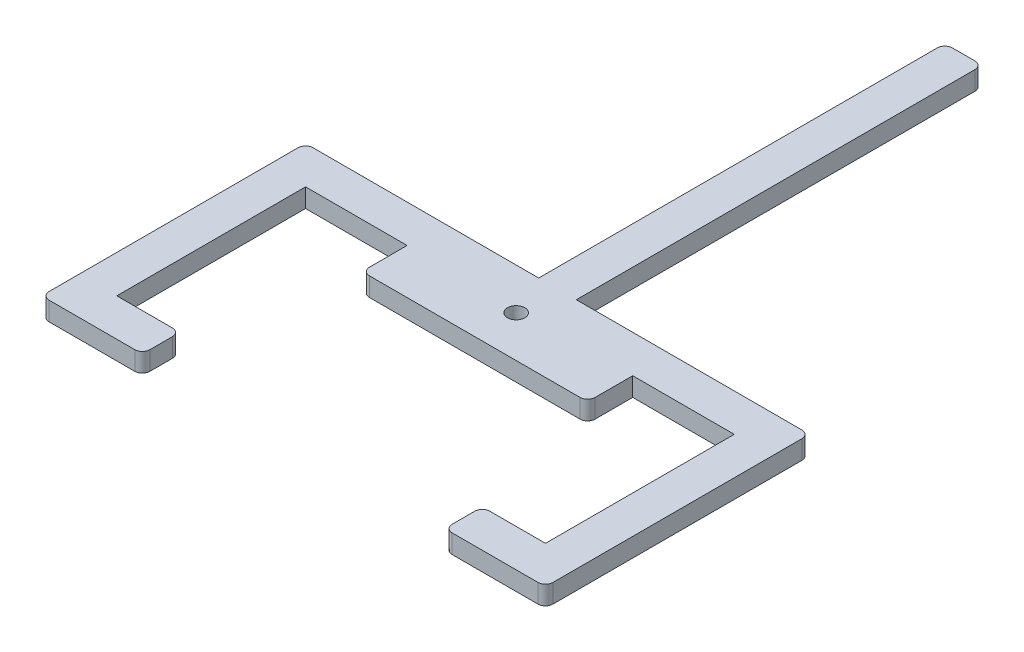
ISO-10303-21;
HEADER;
FILE_DESCRIPTION(('STEP AP214'),'2;1');
FILE_NAME('part.step','',(''),(''),'','','');
FILE_SCHEMA(('AUTOMOTIVE_DESIGN { 1 0 10303 214 1 1 1 1 }'));
ENDSEC;
DATA;
#1=APPLICATION_CONTEXT('core data for automotive mechanical design processes');
#2=APPLICATION_PROTOCOL_DEFINITION('international standard','automotive_design',2000,#1);
#3=PRODUCT_CONTEXT('',#1,'mechanical');
#4=PRODUCT('Part','Part','',(#3));
#5=PRODUCT_RELATED_PRODUCT_CATEGORY('part','',(#4));
#6=PRODUCT_DEFINITION_FORMATION('','',#4);
#7=PRODUCT_DEFINITION_CONTEXT('part definition',#1,'design');
#8=PRODUCT_DEFINITION('design','',#6,#7);
#9=PRODUCT_DEFINITION_SHAPE('','',#8);
#10=(LENGTH_UNIT() NAMED_UNIT(*) SI_UNIT(.MILLI.,.METRE.));
#11=(NAMED_UNIT(*) PLANE_ANGLE_UNIT() SI_UNIT($,.RADIAN.));
#12=(NAMED_UNIT(*) SI_UNIT($,.STERADIAN.) SOLID_ANGLE_UNIT());
#13=UNCERTAINTY_MEASURE_WITH_UNIT(LENGTH_MEASURE(1.E-05),#10,'distance_accuracy_value','');
#14=(GEOMETRIC_REPRESENTATION_CONTEXT(3) GLOBAL_UNCERTAINTY_ASSIGNED_CONTEXT((#13)) GLOBAL_UNIT_ASSIGNED_CONTEXT((#10,
#11,#12)) REPRESENTATION_CONTEXT('',''));
#15=CARTESIAN_POINT('',(0.,0.,0.));
#16=DIRECTION('',(0.,0.,1.));
#17=DIRECTION('',(1.,0.,0.));
#18=AXIS2_PLACEMENT_3D('',#15,#16,#17);
#19=CARTESIAN_POINT('',(39.37,3.175,74.93));
#20=DIRECTION('',(0.,0.,-1.));
#21=DIRECTION('',(-1.,0.,0.));
#22=AXIS2_PLACEMENT_3D('',#19,#20,#21);
#23=PLANE('',#22);
#24=DIRECTION('',(0.,-1.,0.));
#25=VECTOR('',#24,1.);
#26=CARTESIAN_POINT('',(22.225,3.175,74.93));
#27=LINE('',#26,#25);
#28=CARTESIAN_POINT('',(22.225,3.175,74.93));
#29=VERTEX_POINT('',#28);
#30=CARTESIAN_POINT('',(22.225,0.,74.93));
#31=VERTEX_POINT('',#30);
#32=EDGE_CURVE('E250',#29,#31,#27,.T.);
#33=ORIENTED_EDGE('',*,*,#32,.T.);
#34=DIRECTION('',(1.,0.,0.));
#35=VECTOR('',#34,1.);
#36=CARTESIAN_POINT('',(39.37,0.,74.93));
#37=LINE('',#36,#35);
#38=CARTESIAN_POINT('',(39.37,0.,74.93));
#39=VERTEX_POINT('',#38);
#40=EDGE_CURVE('E254',#31,#39,#37,.T.);
#41=ORIENTED_EDGE('',*,*,#40,.T.);
#42=DIRECTION('',(0.,-1.,0.));
#43=VECTOR('',#42,1.);
#44=CARTESIAN_POINT('',(39.37,3.175,74.93));
#45=LINE('',#44,#43);
#46=CARTESIAN_POINT('',(39.37,3.175,74.93));
#47=VERTEX_POINT('',#46);
#48=EDGE_CURVE('E387',#47,#39,#45,.T.);
#49=ORIENTED_EDGE('',*,*,#48,.F.);
#50=DIRECTION('',(1.,0.,0.));
#51=VECTOR('',#50,1.);
#52=CARTESIAN_POINT('',(39.37,3.175,74.93));
#53=LINE('',#52,#51);
#54=EDGE_CURVE('E268',#29,#47,#53,.T.);
#55=ORIENTED_EDGE('',*,*,#54,.F.);
#56=EDGE_LOOP('',(#33,#41,#49,#55));
#57=FACE_BOUND('',#56,.T.);
#58=ADVANCED_FACE('F33',(#57),#23,.F.);
#59=CARTESIAN_POINT('',(0.,3.175,74.93));
#60=DIRECTION('',(0.,0.,-1.));
#61=DIRECTION('',(-1.,0.,0.));
#62=AXIS2_PLACEMENT_3D('',#59,#60,#61);
#63=PLANE('',#62);
#64=DIRECTION('',(0.,-1.,0.));
#65=VECTOR('',#64,1.);
#66=CARTESIAN_POINT('',(-15.875,3.175,74.93));
#67=LINE('',#66,#65);
#68=CARTESIAN_POINT('',(-15.875,3.175,74.93));
#69=VERTEX_POINT('',#68);
#70=CARTESIAN_POINT('',(-15.875,0.,74.93));
#71=VERTEX_POINT('',#70);
#72=EDGE_CURVE('E269',#69,#71,#67,.T.);
#73=ORIENTED_EDGE('',*,*,#72,.F.);
#74=DIRECTION('',(1.,0.,0.));
#75=VECTOR('',#74,1.);
#76=CARTESIAN_POINT('',(0.,3.175,74.93));
#77=LINE('',#76,#75);
#78=CARTESIAN_POINT('',(-33.02,3.175,74.93));
#79=VERTEX_POINT('',#78);
#80=EDGE_CURVE('E333',#79,#69,#77,.T.);
#81=ORIENTED_EDGE('',*,*,#80,.F.);
#82=DIRECTION('',(0.,-1.,0.));
#83=VECTOR('',#82,1.);
#84=CARTESIAN_POINT('',(-33.02,3.175,74.93));
#85=LINE('',#84,#83);
#86=CARTESIAN_POINT('',(-33.02,0.,74.93));
#87=VERTEX_POINT('',#86);
#88=EDGE_CURVE('E389',#79,#87,#85,.T.);
#89=ORIENTED_EDGE('',*,*,#88,.T.);
#90=DIRECTION('',(1.,0.,0.));
#91=VECTOR('',#90,1.);
#92=CARTESIAN_POINT('',(0.,0.,74.93));
#93=LINE('',#92,#91);
#94=EDGE_CURVE('E369',#87,#71,#93,.T.);
#95=ORIENTED_EDGE('',*,*,#94,.T.);
#96=EDGE_LOOP('',(#73,#81,#89,#95));
#97=FACE_BOUND('',#96,.T.);
#98=ADVANCED_FACE('F563',(#97),#63,.F.);
#99=CARTESIAN_POINT('',(39.37,3.175,74.93));
#100=DIRECTION('',(1.,0.,0.));
#101=DIRECTION('',(0.,0.,-1.));
#102=AXIS2_PLACEMENT_3D('',#99,#100,#101);
#103=PLANE('',#102);
#104=DIRECTION('',(0.,-1.,0.));
#105=VECTOR('',#104,1.);
#106=CARTESIAN_POINT('',(39.37,3.175,106.807));
#107=LINE('',#106,#105);
#108=CARTESIAN_POINT('',(39.37,3.175,106.807));
#109=VERTEX_POINT('',#108);
#110=CARTESIAN_POINT('',(39.37,0.,106.807));
#111=VERTEX_POINT('',#110);
#112=EDGE_CURVE('E291',#109,#111,#107,.T.);
#113=ORIENTED_EDGE('',*,*,#112,.F.);
#114=DIRECTION('',(0.,0.,1.));
#115=VECTOR('',#114,1.);
#116=CARTESIAN_POINT('',(39.37,3.175,74.93));
#117=LINE('',#116,#115);
#118=EDGE_CURVE('E345',#47,#109,#117,.T.);
#119=ORIENTED_EDGE('',*,*,#118,.F.);
#120=ORIENTED_EDGE('',*,*,#48,.T.);
#121=DIRECTION('',(0.,0.,1.));
#122=VECTOR('',#121,1.);
#123=CARTESIAN_POINT('',(39.37,0.,74.93));
#124=LINE('',#123,#122);
#125=EDGE_CURVE('E262',#39,#111,#124,.T.);
#126=ORIENTED_EDGE('',*,*,#125,.T.);
#127=EDGE_LOOP('',(#113,#119,#120,#126));
#128=FACE_BOUND('',#127,.T.);
#129=ADVANCED_FACE('F580',(#128),#103,.F.);
#130=CARTESIAN_POINT('',(-33.02,3.175,74.93));
#131=DIRECTION('',(-1.,0.,0.));
#132=DIRECTION('',(0.,0.,1.));
#133=AXIS2_PLACEMENT_3D('',#130,#131,#132);
#134=PLANE('',#133);
#135=DIRECTION('',(0.,1.,0.));
#136=VECTOR('',#135,1.);
#137=CARTESIAN_POINT('',(-33.02,3.175,106.807));
#138=LINE('',#137,#136);
#139=CARTESIAN_POINT('',(-33.02,0.,106.807));
#140=VERTEX_POINT('',#139);
#141=CARTESIAN_POINT('',(-33.02,3.175,106.807));
#142=VERTEX_POINT('',#141);
#143=EDGE_CURVE('E310',#140,#142,#138,.T.);
#144=ORIENTED_EDGE('',*,*,#143,.F.);
#145=DIRECTION('',(0.,0.,-1.));
#146=VECTOR('',#145,1.);
#147=CARTESIAN_POINT('',(-33.02,0.,74.93));
#148=LINE('',#147,#146);
#149=EDGE_CURVE('E367',#140,#87,#148,.T.);
#150=ORIENTED_EDGE('',*,*,#149,.T.);
#151=ORIENTED_EDGE('',*,*,#88,.F.);
#152=DIRECTION('',(0.,0.,-1.));
#153=VECTOR('',#152,1.);
#154=CARTESIAN_POINT('',(-33.02,3.175,74.93));
#155=LINE('',#154,#153);
#156=EDGE_CURVE('E331',#142,#79,#155,.T.);
#157=ORIENTED_EDGE('',*,*,#156,.F.);
#158=EDGE_LOOP('',(#144,#150,#151,#157));
#159=FACE_BOUND('',#158,.T.);
#160=ADVANCED_FACE('F558',(#159),#134,.F.);
#161=CARTESIAN_POINT('',(6.35,3.175,0.));
#162=DIRECTION('',(0.,0.,1.));
#163=DIRECTION('',(1.,0.,0.));
#164=AXIS2_PLACEMENT_3D('',#161,#162,#163);
#165=PLANE('',#164);
#166=DIRECTION('',(-1.,0.,0.));
#167=VECTOR('',#166,1.);
#168=CARTESIAN_POINT('',(6.35,3.175,0.));
#169=LINE('',#168,#167);
#170=CARTESIAN_POINT('',(5.08,3.175,0.));
#171=VERTEX_POINT('',#170);
#172=CARTESIAN_POINT('',(1.27,3.175,0.));
#173=VERTEX_POINT('',#172);
#174=EDGE_CURVE('E319',#171,#173,#169,.T.);
#175=ORIENTED_EDGE('',*,*,#174,.F.);
#176=DIRECTION('',(0.,-1.,0.));
#177=VECTOR('',#176,1.);
#178=CARTESIAN_POINT('',(5.08,3.175,0.));
#179=LINE('',#178,#177);
#180=CARTESIAN_POINT('',(5.08,0.,0.));
#181=VERTEX_POINT('',#180);
#182=EDGE_CURVE('E491',#171,#181,#179,.T.);
#183=ORIENTED_EDGE('',*,*,#182,.T.);
#184=DIRECTION('',(-1.,0.,0.));
#185=VECTOR('',#184,1.);
#186=CARTESIAN_POINT('',(6.35,0.,0.));
#187=LINE('',#186,#185);
#188=CARTESIAN_POINT('',(1.27,0.,0.));
#189=VERTEX_POINT('',#188);
#190=EDGE_CURVE('E318',#181,#189,#187,.T.);
#191=ORIENTED_EDGE('',*,*,#190,.T.);
#192=DIRECTION('',(0.,-1.,0.));
#193=VECTOR('',#192,1.);
#194=CARTESIAN_POINT('',(1.27,3.175,0.));
#195=LINE('',#194,#193);
#196=EDGE_CURVE('E489',#189,#173,#195,.F.);
#197=ORIENTED_EDGE('',*,*,#196,.T.);
#198=EDGE_LOOP('',(#175,#183,#191,#197));
#199=FACE_BOUND('',#198,.T.);
#200=ADVANCED_FACE('F509',(#199),#165,.F.);
#201=CARTESIAN_POINT('',(0.,3.175,0.));
#202=DIRECTION('',(1.,0.,0.));
#203=DIRECTION('',(0.,0.,-1.));
#204=AXIS2_PLACEMENT_3D('',#201,#202,#203);
#205=PLANE('',#204);
#206=DIRECTION('',(0.,0.,1.));
#207=VECTOR('',#206,1.);
#208=CARTESIAN_POINT('',(0.,3.175,0.));
#209=LINE('',#208,#207);
#210=CARTESIAN_POINT('',(0.,3.175,1.27));
#211=VERTEX_POINT('',#210);
#212=CARTESIAN_POINT('',(0.,3.175,68.58));
#213=VERTEX_POINT('',#212);
#214=EDGE_CURVE('E322',#211,#213,#209,.T.);
#215=ORIENTED_EDGE('',*,*,#214,.F.);
#216=DIRECTION('',(0.,-1.,0.));
#217=VECTOR('',#216,1.);
#218=CARTESIAN_POINT('',(0.,3.175,1.27));
#219=LINE('',#218,#217);
#220=CARTESIAN_POINT('',(0.,0.,1.27));
#221=VERTEX_POINT('',#220);
#222=EDGE_CURVE('E11',#211,#221,#219,.T.);
#223=ORIENTED_EDGE('',*,*,#222,.T.);
#224=DIRECTION('',(0.,0.,1.));
#225=VECTOR('',#224,1.);
#226=CARTESIAN_POINT('',(0.,0.,0.));
#227=LINE('',#226,#225);
#228=CARTESIAN_POINT('',(0.,0.,68.58));
#229=VERTEX_POINT('',#228);
#230=EDGE_CURVE('E359',#221,#229,#227,.T.);
#231=ORIENTED_EDGE('',*,*,#230,.T.);
#232=DIRECTION('',(0.,-1.,0.));
#233=VECTOR('',#232,1.);
#234=CARTESIAN_POINT('',(0.,3.175,68.58));
#235=LINE('',#234,#233);
#236=EDGE_CURVE('E392',#213,#229,#235,.T.);
#237=ORIENTED_EDGE('',*,*,#236,.F.);
#238=EDGE_LOOP('',(#215,#223,#231,#237));
#239=FACE_BOUND('',#238,.T.);
#240=ADVANCED_FACE('F518',(#239),#205,.F.);
#241=CARTESIAN_POINT('',(0.,3.175,68.58));
#242=DIRECTION('',(0.,0.,1.));
#243=DIRECTION('',(1.,0.,0.));
#244=AXIS2_PLACEMENT_3D('',#241,#242,#243);
#245=PLANE('',#244);
#246=DIRECTION('',(-1.,0.,0.));
#247=VECTOR('',#246,1.);
#248=CARTESIAN_POINT('',(0.,0.,68.58));
#249=LINE('',#248,#247);
#250=CARTESIAN_POINT('',(-38.1,0.,68.58));
#251=VERTEX_POINT('',#250);
#252=EDGE_CURVE('E361',#229,#251,#249,.T.);
#253=ORIENTED_EDGE('',*,*,#252,.T.);
#254=DIRECTION('',(0.,-1.,0.));
#255=VECTOR('',#254,1.);
#256=CARTESIAN_POINT('',(-38.1,3.175,68.58));
#257=LINE('',#256,#255);
#258=CARTESIAN_POINT('',(-38.1,3.175,68.58));
#259=VERTEX_POINT('',#258);
#260=EDGE_CURVE('E487',#251,#259,#257,.F.);
#261=ORIENTED_EDGE('',*,*,#260,.T.);
#262=DIRECTION('',(-1.,0.,0.));
#263=VECTOR('',#262,1.);
#264=CARTESIAN_POINT('',(0.,3.175,68.58));
#265=LINE('',#264,#263);
#266=EDGE_CURVE('E325',#213,#259,#265,.T.);
#267=ORIENTED_EDGE('',*,*,#266,.F.);
#268=ORIENTED_EDGE('',*,*,#236,.T.);
#269=EDGE_LOOP('',(#253,#261,#267,#268));
#270=FACE_BOUND('',#269,.T.);
#271=ADVANCED_FACE('F645',(#270),#245,.F.);
#272=CARTESIAN_POINT('',(-39.37,3.175,68.58));
#273=DIRECTION('',(1.,0.,0.));
#274=DIRECTION('',(0.,0.,-1.));
#275=AXIS2_PLACEMENT_3D('',#272,#273,#274);
#276=PLANE('',#275);
#277=DIRECTION('',(0.,0.,1.));
#278=VECTOR('',#277,1.);
#279=CARTESIAN_POINT('',(-39.37,0.,68.58));
#280=LINE('',#279,#278);
#281=CARTESIAN_POINT('',(-39.37,0.,69.85));
#282=VERTEX_POINT('',#281);
#283=CARTESIAN_POINT('',(-39.37,0.,111.887));
#284=VERTEX_POINT('',#283);
#285=EDGE_CURVE('E364',#282,#284,#280,.T.);
#286=ORIENTED_EDGE('',*,*,#285,.T.);
#287=DIRECTION('',(0.,-1.,0.));
#288=VECTOR('',#287,1.);
#289=CARTESIAN_POINT('',(-39.37,3.175,111.887));
#290=LINE('',#289,#288);
#291=CARTESIAN_POINT('',(-39.37,3.175,111.887));
#292=VERTEX_POINT('',#291);
#293=EDGE_CURVE('E475',#284,#292,#290,.F.);
#294=ORIENTED_EDGE('',*,*,#293,.T.);
#295=DIRECTION('',(0.,0.,1.));
#296=VECTOR('',#295,1.);
#297=CARTESIAN_POINT('',(-39.37,3.175,68.58));
#298=LINE('',#297,#296);
#299=CARTESIAN_POINT('',(-39.37,3.175,69.85));
#300=VERTEX_POINT('',#299);
#301=EDGE_CURVE('E328',#300,#292,#298,.T.);
#302=ORIENTED_EDGE('',*,*,#301,.F.);
#303=DIRECTION('',(0.,-1.,0.));
#304=VECTOR('',#303,1.);
#305=CARTESIAN_POINT('',(-39.37,3.175,69.85));
#306=LINE('',#305,#304);
#307=EDGE_CURVE('E472',#300,#282,#306,.T.);
#308=ORIENTED_EDGE('',*,*,#307,.T.);
#309=EDGE_LOOP('',(#286,#294,#302,#308));
#310=FACE_BOUND('',#309,.T.);
#311=ADVANCED_FACE('F530',(#310),#276,.F.);
#312=CARTESIAN_POINT('',(-15.875,3.175,79.375));
#313=DIRECTION('',(1.,0.,0.));
#314=DIRECTION('',(0.,0.,-1.));
#315=AXIS2_PLACEMENT_3D('',#312,#313,#314);
#316=PLANE('',#315);
#317=DIRECTION('',(0.,0.,1.));
#318=VECTOR('',#317,1.);
#319=CARTESIAN_POINT('',(-15.875,0.,79.375));
#320=LINE('',#319,#318);
#321=CARTESIAN_POINT('',(-15.875,0.,81.28));
#322=VERTEX_POINT('',#321);
#323=EDGE_CURVE('E372',#71,#322,#320,.T.);
#324=ORIENTED_EDGE('',*,*,#323,.T.);
#325=DIRECTION('',(0.,-1.,0.));
#326=VECTOR('',#325,1.);
#327=CARTESIAN_POINT('',(-15.875,3.175,81.28));
#328=LINE('',#327,#326);
#329=CARTESIAN_POINT('',(-15.875,3.175,81.28));
#330=VERTEX_POINT('',#329);
#331=EDGE_CURVE('E424',#322,#330,#328,.F.);
#332=ORIENTED_EDGE('',*,*,#331,.T.);
#333=DIRECTION('',(0.,0.,1.));
#334=VECTOR('',#333,1.);
#335=CARTESIAN_POINT('',(-15.875,3.175,79.375));
#336=LINE('',#335,#334);
#337=EDGE_CURVE('E336',#69,#330,#336,.T.);
#338=ORIENTED_EDGE('',*,*,#337,.F.);
#339=ORIENTED_EDGE('',*,*,#72,.T.);
#340=EDGE_LOOP('',(#324,#332,#338,#339));
#341=FACE_BOUND('',#340,.T.);
#342=ADVANCED_FACE('F638',(#341),#316,.F.);
#343=CARTESIAN_POINT('',(-15.875,3.175,82.55));
#344=DIRECTION('',(0.,0.,-1.));
#345=DIRECTION('',(-1.,0.,0.));
#346=AXIS2_PLACEMENT_3D('',#343,#344,#345);
#347=PLANE('',#346);
#348=DIRECTION('',(1.,0.,0.));
#349=VECTOR('',#348,1.);
#350=CARTESIAN_POINT('',(-15.875,3.175,82.55));
#351=LINE('',#350,#349);
#352=CARTESIAN_POINT('',(-14.605,3.175,82.55));
#353=VERTEX_POINT('',#352);
#354=CARTESIAN_POINT('',(20.955,3.175,82.55));
#355=VERTEX_POINT('',#354);
#356=EDGE_CURVE('E339',#353,#355,#351,.T.);
#357=ORIENTED_EDGE('',*,*,#356,.F.);
#358=DIRECTION('',(0.,-1.,0.));
#359=VECTOR('',#358,1.);
#360=CARTESIAN_POINT('',(-14.605,3.175,82.55));
#361=LINE('',#360,#359);
#362=CARTESIAN_POINT('',(-14.605,0.,82.55));
#363=VERTEX_POINT('',#362);
#364=EDGE_CURVE('E397',#353,#363,#361,.T.);
#365=ORIENTED_EDGE('',*,*,#364,.T.);
#366=DIRECTION('',(1.,0.,0.));
#367=VECTOR('',#366,1.);
#368=CARTESIAN_POINT('',(-15.875,0.,82.55));
#369=LINE('',#368,#367);
#370=CARTESIAN_POINT('',(20.955,0.,82.55));
#371=VERTEX_POINT('',#370);
#372=EDGE_CURVE('E255',#363,#371,#369,.T.);
#373=ORIENTED_EDGE('',*,*,#372,.T.);
#374=DIRECTION('',(0.,-1.,0.));
#375=VECTOR('',#374,1.);
#376=CARTESIAN_POINT('',(20.955,3.175,82.55));
#377=LINE('',#376,#375);
#378=EDGE_CURVE('E395',#371,#355,#377,.F.);
#379=ORIENTED_EDGE('',*,*,#378,.T.);
#380=EDGE_LOOP('',(#357,#365,#373,#379));
#381=FACE_BOUND('',#380,.T.);
#382=ADVANCED_FACE('F572',(#381),#347,.F.);
#383=CARTESIAN_POINT('',(22.225,3.175,79.375));
#384=DIRECTION('',(-1.,0.,0.));
#385=DIRECTION('',(0.,0.,1.));
#386=AXIS2_PLACEMENT_3D('',#383,#384,#385);
#387=PLANE('',#386);
#388=DIRECTION('',(0.,0.,-1.));
#389=VECTOR('',#388,1.);
#390=CARTESIAN_POINT('',(22.225,3.175,79.375));
#391=LINE('',#390,#389);
#392=CARTESIAN_POINT('',(22.225,3.175,81.28));
#393=VERTEX_POINT('',#392);
#394=EDGE_CURVE('E342',#393,#29,#391,.T.);
#395=ORIENTED_EDGE('',*,*,#394,.F.);
#396=DIRECTION('',(0.,-1.,0.));
#397=VECTOR('',#396,1.);
#398=CARTESIAN_POINT('',(22.225,3.175,81.28));
#399=LINE('',#398,#397);
#400=CARTESIAN_POINT('',(22.225,0.,81.28));
#401=VERTEX_POINT('',#400);
#402=EDGE_CURVE('E252',#393,#401,#399,.T.);
#403=ORIENTED_EDGE('',*,*,#402,.T.);
#404=DIRECTION('',(0.,0.,-1.));
#405=VECTOR('',#404,1.);
#406=CARTESIAN_POINT('',(22.225,0.,79.375));
#407=LINE('',#406,#405);
#408=EDGE_CURVE('E245',#401,#31,#407,.T.);
#409=ORIENTED_EDGE('',*,*,#408,.T.);
#410=ORIENTED_EDGE('',*,*,#32,.F.);
#411=EDGE_LOOP('',(#395,#403,#409,#410));
#412=FACE_BOUND('',#411,.T.);
#413=ADVANCED_FACE('F248',(#412),#387,.F.);
#414=CARTESIAN_POINT('',(45.72,3.175,68.58));
#415=DIRECTION('',(-1.,0.,0.));
#416=DIRECTION('',(0.,0.,1.));
#417=AXIS2_PLACEMENT_3D('',#414,#415,#416);
#418=PLANE('',#417);
#419=DIRECTION('',(0.,0.,-1.));
#420=VECTOR('',#419,1.);
#421=CARTESIAN_POINT('',(45.72,3.175,68.58));
#422=LINE('',#421,#420);
#423=CARTESIAN_POINT('',(45.72,3.175,111.887));
#424=VERTEX_POINT('',#423);
#425=CARTESIAN_POINT('',(45.72,3.175,69.85));
#426=VERTEX_POINT('',#425);
#427=EDGE_CURVE('E348',#424,#426,#422,.T.);
#428=ORIENTED_EDGE('',*,*,#427,.F.);
#429=DIRECTION('',(0.,-1.,0.));
#430=VECTOR('',#429,1.);
#431=CARTESIAN_POINT('',(45.72,3.175,111.887));
#432=LINE('',#431,#430);
#433=CARTESIAN_POINT('',(45.72,0.,111.887));
#434=VERTEX_POINT('',#433);
#435=EDGE_CURVE('E452',#424,#434,#432,.T.);
#436=ORIENTED_EDGE('',*,*,#435,.T.);
#437=DIRECTION('',(0.,0.,-1.));
#438=VECTOR('',#437,1.);
#439=CARTESIAN_POINT('',(45.72,0.,68.58));
#440=LINE('',#439,#438);
#441=CARTESIAN_POINT('',(45.72,0.,69.85));
#442=VERTEX_POINT('',#441);
#443=EDGE_CURVE('E378',#434,#442,#440,.T.);
#444=ORIENTED_EDGE('',*,*,#443,.T.);
#445=DIRECTION('',(0.,-1.,0.));
#446=VECTOR('',#445,1.);
#447=CARTESIAN_POINT('',(45.72,3.175,69.85));
#448=LINE('',#447,#446);
#449=EDGE_CURVE('E450',#442,#426,#448,.F.);
#450=ORIENTED_EDGE('',*,*,#449,.T.);
#451=EDGE_LOOP('',(#428,#436,#444,#450));
#452=FACE_BOUND('',#451,.T.);
#453=ADVANCED_FACE('F609',(#452),#418,.F.);
#454=CARTESIAN_POINT('',(6.34999999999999,3.175,68.58));
#455=DIRECTION('',(0.,0.,1.));
#456=DIRECTION('',(1.,0.,0.));
#457=AXIS2_PLACEMENT_3D('',#454,#455,#456);
#458=PLANE('',#457);
#459=DIRECTION('',(-1.,0.,0.));
#460=VECTOR('',#459,1.);
#461=CARTESIAN_POINT('',(6.34999999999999,3.175,68.58));
#462=LINE('',#461,#460);
#463=CARTESIAN_POINT('',(44.45,3.175,68.58));
#464=VERTEX_POINT('',#463);
#465=CARTESIAN_POINT('',(6.34999999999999,3.175,68.58));
#466=VERTEX_POINT('',#465);
#467=EDGE_CURVE('E351',#464,#466,#462,.T.);
#468=ORIENTED_EDGE('',*,*,#467,.F.);
#469=DIRECTION('',(0.,-1.,0.));
#470=VECTOR('',#469,1.);
#471=CARTESIAN_POINT('',(44.45,3.175,68.58));
#472=LINE('',#471,#470);
#473=CARTESIAN_POINT('',(44.45,0.,68.58));
#474=VERTEX_POINT('',#473);
#475=EDGE_CURVE('E484',#464,#474,#472,.T.);
#476=ORIENTED_EDGE('',*,*,#475,.T.);
#477=DIRECTION('',(-1.,0.,0.));
#478=VECTOR('',#477,1.);
#479=CARTESIAN_POINT('',(6.34999999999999,0.,68.58));
#480=LINE('',#479,#478);
#481=CARTESIAN_POINT('',(6.34999999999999,0.,68.58));
#482=VERTEX_POINT('',#481);
#483=EDGE_CURVE('E381',#474,#482,#480,.T.);
#484=ORIENTED_EDGE('',*,*,#483,.T.);
#485=DIRECTION('',(0.,-1.,0.));
#486=VECTOR('',#485,1.);
#487=CARTESIAN_POINT('',(6.34999999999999,3.175,68.58));
#488=LINE('',#487,#486);
#489=EDGE_CURVE('E356',#466,#482,#488,.T.);
#490=ORIENTED_EDGE('',*,*,#489,.F.);
#491=EDGE_LOOP('',(#468,#476,#484,#490));
#492=FACE_BOUND('',#491,.T.);
#493=ADVANCED_FACE('F617',(#492),#458,.F.);
#494=CARTESIAN_POINT('',(6.34999999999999,3.175,68.58));
#495=DIRECTION('',(-1.,0.,0.));
#496=DIRECTION('',(0.,0.,1.));
#497=AXIS2_PLACEMENT_3D('',#494,#495,#496);
#498=PLANE('',#497);
#499=DIRECTION('',(0.,0.,-1.));
#500=VECTOR('',#499,1.);
#501=CARTESIAN_POINT('',(6.34999999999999,0.,68.58));
#502=LINE('',#501,#500);
#503=CARTESIAN_POINT('',(6.35,0.,1.26999999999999));
#504=VERTEX_POINT('',#503);
#505=EDGE_CURVE('E323',#482,#504,#502,.T.);
#506=ORIENTED_EDGE('',*,*,#505,.T.);
#507=DIRECTION('',(0.,-1.,0.));
#508=VECTOR('',#507,1.);
#509=CARTESIAN_POINT('',(6.35,3.175,1.26999999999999));
#510=LINE('',#509,#508);
#511=CARTESIAN_POINT('',(6.35,3.175,1.26999999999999));
#512=VERTEX_POINT('',#511);
#513=EDGE_CURVE('E41',#504,#512,#510,.F.);
#514=ORIENTED_EDGE('',*,*,#513,.T.);
#515=DIRECTION('',(0.,0.,-1.));
#516=VECTOR('',#515,1.);
#517=CARTESIAN_POINT('',(6.34999999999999,3.175,68.58));
#518=LINE('',#517,#516);
#519=EDGE_CURVE('E353',#466,#512,#518,.T.);
#520=ORIENTED_EDGE('',*,*,#519,.F.);
#521=ORIENTED_EDGE('',*,*,#489,.T.);
#522=EDGE_LOOP('',(#506,#514,#520,#521));
#523=FACE_BOUND('',#522,.T.);
#524=ADVANCED_FACE('F496',(#523),#498,.F.);
#525=CARTESIAN_POINT('',(0.,3.175,0.));
#526=DIRECTION('',(0.,1.,0.));
#527=DIRECTION('',(0.,0.,1.));
#528=AXIS2_PLACEMENT_3D('',#525,#526,#527);
#529=PLANE('',#528);
#530=ORIENTED_EDGE('',*,*,#337,.T.);
#531=CARTESIAN_POINT('',(-14.605,3.175,81.28));
#532=DIRECTION('',(0.,1.,0.));
#533=DIRECTION('',(0.,0.,1.));
#534=AXIS2_PLACEMENT_3D('',#531,#532,#533);
#535=CIRCLE('',#534,1.27);
#536=EDGE_CURVE('E447',#330,#353,#535,.T.);
#537=ORIENTED_EDGE('',*,*,#536,.T.);
#538=ORIENTED_EDGE('',*,*,#356,.T.);
#539=CARTESIAN_POINT('',(20.955,3.175,81.28));
#540=DIRECTION('',(0.,1.,0.));
#541=DIRECTION('',(0.,0.,1.));
#542=AXIS2_PLACEMENT_3D('',#539,#540,#541);
#543=CIRCLE('',#542,1.27);
#544=EDGE_CURVE('E445',#355,#393,#543,.T.);
#545=ORIENTED_EDGE('',*,*,#544,.T.);
#546=ORIENTED_EDGE('',*,*,#394,.T.);
#547=ORIENTED_EDGE('',*,*,#54,.T.);
#548=ORIENTED_EDGE('',*,*,#118,.T.);
#549=DIRECTION('',(-1.,0.,0.));
#550=VECTOR('',#549,1.);
#551=CARTESIAN_POINT('',(45.72,3.175,106.807));
#552=LINE('',#551,#550);
#553=CARTESIAN_POINT('',(29.972,3.175,106.807));
#554=VERTEX_POINT('',#553);
#555=EDGE_CURVE('E281',#109,#554,#552,.T.);
#556=ORIENTED_EDGE('',*,*,#555,.T.);
#557=CARTESIAN_POINT('',(29.972,3.175,108.077));
#558=DIRECTION('',(0.,1.,0.));
#559=DIRECTION('',(0.,0.,1.));
#560=AXIS2_PLACEMENT_3D('',#557,#558,#559);
#561=CIRCLE('',#560,1.27);
#562=CARTESIAN_POINT('',(28.702,3.175,108.077));
#563=VERTEX_POINT('',#562);
#564=EDGE_CURVE('E434',#554,#563,#561,.T.);
#565=ORIENTED_EDGE('',*,*,#564,.T.);
#566=DIRECTION('',(0.,0.,1.));
#567=VECTOR('',#566,1.);
#568=CARTESIAN_POINT('',(28.702,3.175,106.807));
#569=LINE('',#568,#567);
#570=CARTESIAN_POINT('',(28.702,3.175,111.887));
#571=VERTEX_POINT('',#570);
#572=EDGE_CURVE('E284',#563,#571,#569,.T.);
#573=ORIENTED_EDGE('',*,*,#572,.T.);
#574=CARTESIAN_POINT('',(29.972,3.175,111.887));
#575=DIRECTION('',(0.,1.,0.));
#576=DIRECTION('',(0.,0.,1.));
#577=AXIS2_PLACEMENT_3D('',#574,#575,#576);
#578=CIRCLE('',#577,1.27);
#579=CARTESIAN_POINT('',(29.972,3.175,113.157));
#580=VERTEX_POINT('',#579);
#581=EDGE_CURVE('E436',#571,#580,#578,.T.);
#582=ORIENTED_EDGE('',*,*,#581,.T.);
#583=DIRECTION('',(1.,0.,0.));
#584=VECTOR('',#583,1.);
#585=CARTESIAN_POINT('',(45.72,3.175,113.157));
#586=LINE('',#585,#584);
#587=CARTESIAN_POINT('',(44.45,3.175,113.157));
#588=VERTEX_POINT('',#587);
#589=EDGE_CURVE('E288',#580,#588,#586,.T.);
#590=ORIENTED_EDGE('',*,*,#589,.T.);
#591=CARTESIAN_POINT('',(44.45,3.175,111.887));
#592=DIRECTION('',(0.,1.,0.));
#593=DIRECTION('',(0.,0.,1.));
#594=AXIS2_PLACEMENT_3D('',#591,#592,#593);
#595=CIRCLE('',#594,1.27);
#596=EDGE_CURVE('E443',#588,#424,#595,.T.);
#597=ORIENTED_EDGE('',*,*,#596,.T.);
#598=ORIENTED_EDGE('',*,*,#427,.T.);
#599=CARTESIAN_POINT('',(44.45,3.175,69.85));
#600=DIRECTION('',(0.,1.,0.));
#601=DIRECTION('',(0.,0.,1.));
#602=AXIS2_PLACEMENT_3D('',#599,#600,#601);
#603=CIRCLE('',#602,1.27);
#604=EDGE_CURVE('E432',#426,#464,#603,.T.);
#605=ORIENTED_EDGE('',*,*,#604,.T.);
#606=ORIENTED_EDGE('',*,*,#467,.T.);
#607=ORIENTED_EDGE('',*,*,#519,.T.);
#608=CARTESIAN_POINT('',(5.08,3.175,1.27));
#609=DIRECTION('',(0.,1.,0.));
#610=DIRECTION('',(0.,0.,1.));
#611=AXIS2_PLACEMENT_3D('',#608,#609,#610);
#612=CIRCLE('',#611,1.27);
#613=EDGE_CURVE('E428',#512,#171,#612,.T.);
#614=ORIENTED_EDGE('',*,*,#613,.T.);
#615=ORIENTED_EDGE('',*,*,#174,.T.);
#616=CARTESIAN_POINT('',(1.27,3.175,1.27));
#617=DIRECTION('',(0.,1.,0.));
#618=DIRECTION('',(0.,0.,1.));
#619=AXIS2_PLACEMENT_3D('',#616,#617,#618);
#620=CIRCLE('',#619,1.27);
#621=EDGE_CURVE('E426',#173,#211,#620,.T.);
#622=ORIENTED_EDGE('',*,*,#621,.T.);
#623=ORIENTED_EDGE('',*,*,#214,.T.);
#624=ORIENTED_EDGE('',*,*,#266,.T.);
#625=CARTESIAN_POINT('',(-38.1,3.175,69.85));
#626=DIRECTION('',(0.,1.,0.));
#627=DIRECTION('',(0.,0.,1.));
#628=AXIS2_PLACEMENT_3D('',#625,#626,#627);
#629=CIRCLE('',#628,1.27);
#630=EDGE_CURVE('E430',#259,#300,#629,.T.);
#631=ORIENTED_EDGE('',*,*,#630,.T.);
#632=ORIENTED_EDGE('',*,*,#301,.T.);
#633=CARTESIAN_POINT('',(-38.1,3.175,111.887));
#634=DIRECTION('',(0.,1.,0.));
#635=DIRECTION('',(0.,0.,1.));
#636=AXIS2_PLACEMENT_3D('',#633,#634,#635);
#637=CIRCLE('',#636,1.27);
#638=CARTESIAN_POINT('',(-38.1,3.175,113.157));
#639=VERTEX_POINT('',#638);
#640=EDGE_CURVE('E438',#292,#639,#637,.T.);
#641=ORIENTED_EDGE('',*,*,#640,.T.);
#642=DIRECTION('',(1.,0.,0.));
#643=VECTOR('',#642,1.);
#644=CARTESIAN_POINT('',(-39.37,3.175,113.157));
#645=LINE('',#644,#643);
#646=CARTESIAN_POINT('',(-23.622,3.175,113.157));
#647=VERTEX_POINT('',#646);
#648=EDGE_CURVE('E302',#639,#647,#645,.T.);
#649=ORIENTED_EDGE('',*,*,#648,.T.);
#650=CARTESIAN_POINT('',(-23.622,3.175,111.887));
#651=DIRECTION('',(0.,1.,0.));
#652=DIRECTION('',(0.,0.,1.));
#653=AXIS2_PLACEMENT_3D('',#650,#651,#652);
#654=CIRCLE('',#653,1.27);
#655=CARTESIAN_POINT('',(-22.352,3.175,111.887));
#656=VERTEX_POINT('',#655);
#657=EDGE_CURVE('E441',#647,#656,#654,.T.);
#658=ORIENTED_EDGE('',*,*,#657,.T.);
#659=DIRECTION('',(0.,0.,-1.));
#660=VECTOR('',#659,1.);
#661=CARTESIAN_POINT('',(-22.352,3.175,106.807));
#662=LINE('',#661,#660);
#663=CARTESIAN_POINT('',(-22.352,3.175,108.077));
#664=VERTEX_POINT('',#663);
#665=EDGE_CURVE('E305',#656,#664,#662,.T.);
#666=ORIENTED_EDGE('',*,*,#665,.T.);
#667=CARTESIAN_POINT('',(-23.622,3.175,108.077));
#668=DIRECTION('',(0.,1.,0.));
#669=DIRECTION('',(0.,0.,1.));
#670=AXIS2_PLACEMENT_3D('',#667,#668,#669);
#671=CIRCLE('',#670,1.27);
#672=CARTESIAN_POINT('',(-23.622,3.175,106.807));
#673=VERTEX_POINT('',#672);
#674=EDGE_CURVE('E48',#664,#673,#671,.T.);
#675=ORIENTED_EDGE('',*,*,#674,.T.);
#676=DIRECTION('',(-1.,0.,0.));
#677=VECTOR('',#676,1.);
#678=CARTESIAN_POINT('',(-39.37,3.175,106.807));
#679=LINE('',#678,#677);
#680=EDGE_CURVE('E308',#673,#142,#679,.T.);
#681=ORIENTED_EDGE('',*,*,#680,.T.);
#682=ORIENTED_EDGE('',*,*,#156,.T.);
#683=ORIENTED_EDGE('',*,*,#80,.T.);
#684=EDGE_LOOP('',(#530,#537,#538,#545,#546,#547,#548,#556,#565,#573,#582,#590,#597,#598,#605,
#606,#607,#614,#615,#622,#623,#624,#631,#632,#641,#649,#658,#666,#675,#681,#682,#683));
#685=FACE_BOUND('',#684,.T.);
#686=CARTESIAN_POINT('',(3.175,3.175,75.565));
#687=DIRECTION('',(0.,1.,0.));
#688=DIRECTION('',(0.,0.,1.));
#689=AXIS2_PLACEMENT_3D('',#686,#687,#688);
#690=CIRCLE('',#689,1.47319999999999);
#691=CARTESIAN_POINT('',(3.175,3.175,77.0382));
#692=VERTEX_POINT('',#691);
#693=EDGE_CURVE('E272',#692,#692,#690,.T.);
#694=ORIENTED_EDGE('',*,*,#693,.F.);
#695=EDGE_LOOP('',(#694));
#696=FACE_BOUND('',#695,.T.);
#697=ADVANCED_FACE('F500',(#685,#696),#529,.T.);
#698=CARTESIAN_POINT('',(0.,0.,0.));
#699=DIRECTION('',(0.,1.,0.));
#700=DIRECTION('',(0.,0.,1.));
#701=AXIS2_PLACEMENT_3D('',#698,#699,#700);
#702=PLANE('',#701);
#703=ORIENTED_EDGE('',*,*,#372,.F.);
#704=CARTESIAN_POINT('',(-14.605,0.,81.28));
#705=DIRECTION('',(0.,1.,0.));
#706=DIRECTION('',(0.,0.,1.));
#707=AXIS2_PLACEMENT_3D('',#704,#705,#706);
#708=CIRCLE('',#707,1.27);
#709=EDGE_CURVE('E422',#363,#322,#708,.F.);
#710=ORIENTED_EDGE('',*,*,#709,.T.);
#711=ORIENTED_EDGE('',*,*,#323,.F.);
#712=ORIENTED_EDGE('',*,*,#94,.F.);
#713=ORIENTED_EDGE('',*,*,#149,.F.);
#714=DIRECTION('',(-1.,0.,0.));
#715=VECTOR('',#714,1.);
#716=CARTESIAN_POINT('',(-39.37,0.,106.807));
#717=LINE('',#716,#715);
#718=CARTESIAN_POINT('',(-23.622,0.,106.807));
#719=VERTEX_POINT('',#718);
#720=EDGE_CURVE('E306',#719,#140,#717,.T.);
#721=ORIENTED_EDGE('',*,*,#720,.F.);
#722=CARTESIAN_POINT('',(-23.622,0.,108.077));
#723=DIRECTION('',(0.,1.,0.));
#724=DIRECTION('',(0.,0.,1.));
#725=AXIS2_PLACEMENT_3D('',#722,#723,#724);
#726=CIRCLE('',#725,1.27);
#727=CARTESIAN_POINT('',(-22.352,0.,108.077));
#728=VERTEX_POINT('',#727);
#729=EDGE_CURVE('E414',#719,#728,#726,.F.);
#730=ORIENTED_EDGE('',*,*,#729,.T.);
#731=DIRECTION('',(0.,0.,-1.));
#732=VECTOR('',#731,1.);
#733=CARTESIAN_POINT('',(-22.352,0.,106.807));
#734=LINE('',#733,#732);
#735=CARTESIAN_POINT('',(-22.352,0.,111.887));
#736=VERTEX_POINT('',#735);
#737=EDGE_CURVE('E313',#736,#728,#734,.T.);
#738=ORIENTED_EDGE('',*,*,#737,.F.);
#739=CARTESIAN_POINT('',(-23.622,0.,111.887));
#740=DIRECTION('',(0.,1.,0.));
#741=DIRECTION('',(0.,0.,1.));
#742=AXIS2_PLACEMENT_3D('',#739,#740,#741);
#743=CIRCLE('',#742,1.27);
#744=CARTESIAN_POINT('',(-23.622,0.,113.157));
#745=VERTEX_POINT('',#744);
#746=EDGE_CURVE('E416',#736,#745,#743,.F.);
#747=ORIENTED_EDGE('',*,*,#746,.T.);
#748=DIRECTION('',(1.,0.,0.));
#749=VECTOR('',#748,1.);
#750=CARTESIAN_POINT('',(-39.37,0.,113.157));
#751=LINE('',#750,#749);
#752=CARTESIAN_POINT('',(-38.1,0.,113.157));
#753=VERTEX_POINT('',#752);
#754=EDGE_CURVE('E301',#753,#745,#751,.T.);
#755=ORIENTED_EDGE('',*,*,#754,.F.);
#756=CARTESIAN_POINT('',(-38.1,0.,111.887));
#757=DIRECTION('',(0.,1.,0.));
#758=DIRECTION('',(0.,0.,1.));
#759=AXIS2_PLACEMENT_3D('',#756,#757,#758);
#760=CIRCLE('',#759,1.27);
#761=EDGE_CURVE('E412',#753,#284,#760,.F.);
#762=ORIENTED_EDGE('',*,*,#761,.T.);
#763=ORIENTED_EDGE('',*,*,#285,.F.);
#764=CARTESIAN_POINT('',(-38.1,0.,69.85));
#765=DIRECTION('',(0.,1.,0.));
#766=DIRECTION('',(0.,0.,1.));
#767=AXIS2_PLACEMENT_3D('',#764,#765,#766);
#768=CIRCLE('',#767,1.27);
#769=EDGE_CURVE('E404',#282,#251,#768,.F.);
#770=ORIENTED_EDGE('',*,*,#769,.T.);
#771=ORIENTED_EDGE('',*,*,#252,.F.);
#772=ORIENTED_EDGE('',*,*,#230,.F.);
#773=CARTESIAN_POINT('',(1.27,0.,1.27));
#774=DIRECTION('',(0.,1.,0.));
#775=DIRECTION('',(0.,0.,1.));
#776=AXIS2_PLACEMENT_3D('',#773,#774,#775);
#777=CIRCLE('',#776,1.27);
#778=EDGE_CURVE('E400',#221,#189,#777,.F.);
#779=ORIENTED_EDGE('',*,*,#778,.T.);
#780=ORIENTED_EDGE('',*,*,#190,.F.);
#781=CARTESIAN_POINT('',(5.08,0.,1.27));
#782=DIRECTION('',(0.,1.,0.));
#783=DIRECTION('',(0.,0.,1.));
#784=AXIS2_PLACEMENT_3D('',#781,#782,#783);
#785=CIRCLE('',#784,1.27);
#786=EDGE_CURVE('E402',#181,#504,#785,.F.);
#787=ORIENTED_EDGE('',*,*,#786,.T.);
#788=ORIENTED_EDGE('',*,*,#505,.F.);
#789=ORIENTED_EDGE('',*,*,#483,.F.);
#790=CARTESIAN_POINT('',(44.45,0.,69.85));
#791=DIRECTION('',(0.,1.,0.));
#792=DIRECTION('',(0.,0.,1.));
#793=AXIS2_PLACEMENT_3D('',#790,#791,#792);
#794=CIRCLE('',#793,1.27);
#795=EDGE_CURVE('E406',#474,#442,#794,.F.);
#796=ORIENTED_EDGE('',*,*,#795,.T.);
#797=ORIENTED_EDGE('',*,*,#443,.F.);
#798=CARTESIAN_POINT('',(44.45,0.,111.887));
#799=DIRECTION('',(0.,1.,0.));
#800=DIRECTION('',(0.,0.,1.));
#801=AXIS2_PLACEMENT_3D('',#798,#799,#800);
#802=CIRCLE('',#801,1.27);
#803=CARTESIAN_POINT('',(44.45,0.,113.157));
#804=VERTEX_POINT('',#803);
#805=EDGE_CURVE('E418',#434,#804,#802,.F.);
#806=ORIENTED_EDGE('',*,*,#805,.T.);
#807=DIRECTION('',(1.,0.,0.));
#808=VECTOR('',#807,1.);
#809=CARTESIAN_POINT('',(45.72,0.,113.157));
#810=LINE('',#809,#808);
#811=CARTESIAN_POINT('',(29.972,0.,113.157));
#812=VERTEX_POINT('',#811);
#813=EDGE_CURVE('E285',#812,#804,#810,.T.);
#814=ORIENTED_EDGE('',*,*,#813,.F.);
#815=CARTESIAN_POINT('',(29.972,0.,111.887));
#816=DIRECTION('',(0.,1.,0.));
#817=DIRECTION('',(0.,0.,1.));
#818=AXIS2_PLACEMENT_3D('',#815,#816,#817);
#819=CIRCLE('',#818,1.27);
#820=CARTESIAN_POINT('',(28.702,0.,111.887));
#821=VERTEX_POINT('',#820);
#822=EDGE_CURVE('E410',#812,#821,#819,.F.);
#823=ORIENTED_EDGE('',*,*,#822,.T.);
#824=DIRECTION('',(0.,0.,1.));
#825=VECTOR('',#824,1.);
#826=CARTESIAN_POINT('',(28.702,0.,106.807));
#827=LINE('',#826,#825);
#828=CARTESIAN_POINT('',(28.702,0.,108.077));
#829=VERTEX_POINT('',#828);
#830=EDGE_CURVE('E294',#829,#821,#827,.T.);
#831=ORIENTED_EDGE('',*,*,#830,.F.);
#832=CARTESIAN_POINT('',(29.972,0.,108.077));
#833=DIRECTION('',(0.,1.,0.));
#834=DIRECTION('',(0.,0.,1.));
#835=AXIS2_PLACEMENT_3D('',#832,#833,#834);
#836=CIRCLE('',#835,1.27);
#837=CARTESIAN_POINT('',(29.972,0.,106.807));
#838=VERTEX_POINT('',#837);
#839=EDGE_CURVE('E408',#829,#838,#836,.F.);
#840=ORIENTED_EDGE('',*,*,#839,.T.);
#841=DIRECTION('',(-1.,0.,0.));
#842=VECTOR('',#841,1.);
#843=CARTESIAN_POINT('',(45.72,0.,106.807));
#844=LINE('',#843,#842);
#845=EDGE_CURVE('E280',#111,#838,#844,.T.);
#846=ORIENTED_EDGE('',*,*,#845,.F.);
#847=ORIENTED_EDGE('',*,*,#125,.F.);
#848=ORIENTED_EDGE('',*,*,#40,.F.);
#849=ORIENTED_EDGE('',*,*,#408,.F.);
#850=CARTESIAN_POINT('',(20.955,0.,81.28));
#851=DIRECTION('',(0.,1.,0.));
#852=DIRECTION('',(0.,0.,1.));
#853=AXIS2_PLACEMENT_3D('',#850,#851,#852);
#854=CIRCLE('',#853,1.27);
#855=EDGE_CURVE('E420',#401,#371,#854,.F.);
#856=ORIENTED_EDGE('',*,*,#855,.T.);
#857=EDGE_LOOP('',(#703,#710,#711,#712,#713,#721,#730,#738,#747,#755,#762,#763,#770,#771,#772,
#779,#780,#787,#788,#789,#796,#797,#806,#814,#823,#831,#840,#846,#847,#848,#849,#856));
#858=FACE_BOUND('',#857,.T.);
#859=CARTESIAN_POINT('',(3.175,0.,75.565));
#860=DIRECTION('',(0.,1.,0.));
#861=DIRECTION('',(0.,0.,1.));
#862=AXIS2_PLACEMENT_3D('',#859,#860,#861);
#863=CIRCLE('',#862,1.4732);
#864=CARTESIAN_POINT('',(3.175,0.,77.0382));
#865=VERTEX_POINT('',#864);
#866=EDGE_CURVE('E277',#865,#865,#863,.T.);
#867=ORIENTED_EDGE('',*,*,#866,.T.);
#868=EDGE_LOOP('',(#867));
#869=FACE_BOUND('',#868,.T.);
#870=ADVANCED_FACE('F259',(#858,#869),#702,.F.);
#871=CARTESIAN_POINT('',(-39.37,3.175,106.807));
#872=DIRECTION('',(0.,0.,1.));
#873=DIRECTION('',(1.,0.,0.));
#874=AXIS2_PLACEMENT_3D('',#871,#872,#873);
#875=PLANE('',#874);
#876=ORIENTED_EDGE('',*,*,#680,.F.);
#877=DIRECTION('',(0.,-1.,0.));
#878=VECTOR('',#877,1.);
#879=CARTESIAN_POINT('',(-23.622,3.175,106.807));
#880=LINE('',#879,#878);
#881=EDGE_CURVE('E469',#673,#719,#880,.T.);
#882=ORIENTED_EDGE('',*,*,#881,.T.);
#883=ORIENTED_EDGE('',*,*,#720,.T.);
#884=ORIENTED_EDGE('',*,*,#143,.T.);
#885=EDGE_LOOP('',(#876,#882,#883,#884));
#886=FACE_BOUND('',#885,.T.);
#887=ADVANCED_FACE('F553',(#886),#875,.F.);
#888=CARTESIAN_POINT('',(-39.37,3.175,113.157));
#889=DIRECTION('',(0.,0.,-1.));
#890=DIRECTION('',(-1.,0.,0.));
#891=AXIS2_PLACEMENT_3D('',#888,#889,#890);
#892=PLANE('',#891);
#893=ORIENTED_EDGE('',*,*,#754,.T.);
#894=DIRECTION('',(0.,-1.,0.));
#895=VECTOR('',#894,1.);
#896=CARTESIAN_POINT('',(-23.622,3.175,113.157));
#897=LINE('',#896,#895);
#898=EDGE_CURVE('E467',#745,#647,#897,.F.);
#899=ORIENTED_EDGE('',*,*,#898,.T.);
#900=ORIENTED_EDGE('',*,*,#648,.F.);
#901=DIRECTION('',(0.,-1.,0.));
#902=VECTOR('',#901,1.);
#903=CARTESIAN_POINT('',(-38.1,3.175,113.157));
#904=LINE('',#903,#902);
#905=EDGE_CURVE('E464',#639,#753,#904,.T.);
#906=ORIENTED_EDGE('',*,*,#905,.T.);
#907=EDGE_LOOP('',(#893,#899,#900,#906));
#908=FACE_BOUND('',#907,.T.);
#909=ADVANCED_FACE('F539',(#908),#892,.F.);
#910=CARTESIAN_POINT('',(-22.352,3.175,106.807));
#911=DIRECTION('',(-1.,0.,0.));
#912=DIRECTION('',(0.,0.,1.));
#913=AXIS2_PLACEMENT_3D('',#910,#911,#912);
#914=PLANE('',#913);
#915=ORIENTED_EDGE('',*,*,#665,.F.);
#916=DIRECTION('',(0.,-1.,0.));
#917=VECTOR('',#916,1.);
#918=CARTESIAN_POINT('',(-22.352,3.175,111.887));
#919=LINE('',#918,#917);
#920=EDGE_CURVE('E461',#656,#736,#919,.T.);
#921=ORIENTED_EDGE('',*,*,#920,.T.);
#922=ORIENTED_EDGE('',*,*,#737,.T.);
#923=DIRECTION('',(0.,-1.,0.));
#924=VECTOR('',#923,1.);
#925=CARTESIAN_POINT('',(-22.352,3.175,108.077));
#926=LINE('',#925,#924);
#927=EDGE_CURVE('E56',#728,#664,#926,.F.);
#928=ORIENTED_EDGE('',*,*,#927,.T.);
#929=EDGE_LOOP('',(#915,#921,#922,#928));
#930=FACE_BOUND('',#929,.T.);
#931=ADVANCED_FACE('F546',(#930),#914,.F.);
#932=CARTESIAN_POINT('',(45.72,3.175,106.807));
#933=DIRECTION('',(0.,0.,1.));
#934=DIRECTION('',(1.,0.,0.));
#935=AXIS2_PLACEMENT_3D('',#932,#933,#934);
#936=PLANE('',#935);
#937=ORIENTED_EDGE('',*,*,#845,.T.);
#938=DIRECTION('',(0.,-1.,0.));
#939=VECTOR('',#938,1.);
#940=CARTESIAN_POINT('',(29.972,3.175,106.807));
#941=LINE('',#940,#939);
#942=EDGE_CURVE('E482',#838,#554,#941,.F.);
#943=ORIENTED_EDGE('',*,*,#942,.T.);
#944=ORIENTED_EDGE('',*,*,#555,.F.);
#945=ORIENTED_EDGE('',*,*,#112,.T.);
#946=EDGE_LOOP('',(#937,#943,#944,#945));
#947=FACE_BOUND('',#946,.T.);
#948=ADVANCED_FACE('F582',(#947),#936,.F.);
#949=CARTESIAN_POINT('',(28.702,3.175,106.807));
#950=DIRECTION('',(1.,0.,0.));
#951=DIRECTION('',(0.,0.,-1.));
#952=AXIS2_PLACEMENT_3D('',#949,#950,#951);
#953=PLANE('',#952);
#954=ORIENTED_EDGE('',*,*,#830,.T.);
#955=DIRECTION('',(0.,-1.,0.));
#956=VECTOR('',#955,1.);
#957=CARTESIAN_POINT('',(28.702,3.175,111.887));
#958=LINE('',#957,#956);
#959=EDGE_CURVE('E480',#821,#571,#958,.F.);
#960=ORIENTED_EDGE('',*,*,#959,.T.);
#961=ORIENTED_EDGE('',*,*,#572,.F.);
#962=DIRECTION('',(0.,-1.,0.));
#963=VECTOR('',#962,1.);
#964=CARTESIAN_POINT('',(28.702,3.175,108.077));
#965=LINE('',#964,#963);
#966=EDGE_CURVE('E477',#563,#829,#965,.T.);
#967=ORIENTED_EDGE('',*,*,#966,.T.);
#968=EDGE_LOOP('',(#954,#960,#961,#967));
#969=FACE_BOUND('',#968,.T.);
#970=ADVANCED_FACE('F591',(#969),#953,.F.);
#971=CARTESIAN_POINT('',(45.72,3.175,113.157));
#972=DIRECTION('',(0.,0.,-1.));
#973=DIRECTION('',(-1.,0.,0.));
#974=AXIS2_PLACEMENT_3D('',#971,#972,#973);
#975=PLANE('',#974);
#976=ORIENTED_EDGE('',*,*,#813,.T.);
#977=DIRECTION('',(0.,-1.,0.));
#978=VECTOR('',#977,1.);
#979=CARTESIAN_POINT('',(44.45,3.175,113.157));
#980=LINE('',#979,#978);
#981=EDGE_CURVE('E458',#804,#588,#980,.F.);
#982=ORIENTED_EDGE('',*,*,#981,.T.);
#983=ORIENTED_EDGE('',*,*,#589,.F.);
#984=DIRECTION('',(0.,-1.,0.));
#985=VECTOR('',#984,1.);
#986=CARTESIAN_POINT('',(29.972,3.175,113.157));
#987=LINE('',#986,#985);
#988=EDGE_CURVE('E455',#580,#812,#987,.T.);
#989=ORIENTED_EDGE('',*,*,#988,.T.);
#990=EDGE_LOOP('',(#976,#982,#983,#989));
#991=FACE_BOUND('',#990,.T.);
#992=ADVANCED_FACE('F600',(#991),#975,.F.);
#993=CARTESIAN_POINT('',(3.175,3.175,75.565));
#994=DIRECTION('',(0.,1.,0.));
#995=DIRECTION('',(0.,0.,1.));
#996=AXIS2_PLACEMENT_3D('',#993,#994,#995);
#997=CYLINDRICAL_SURFACE('',#996,1.47319999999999);
#998=ORIENTED_EDGE('',*,*,#866,.F.);
#999=EDGE_LOOP('',(#998));
#1000=FACE_BOUND('',#999,.T.);
#1001=ORIENTED_EDGE('',*,*,#693,.T.);
#1002=EDGE_LOOP('',(#1001));
#1003=FACE_BOUND('',#1002,.T.);
#1004=ADVANCED_FACE('F654',(#1000,#1003),#997,.F.);
#1005=CARTESIAN_POINT('',(-14.605,3.175,81.28));
#1006=DIRECTION('',(0.,-1.,0.));
#1007=DIRECTION('',(0.,0.,-1.));
#1008=AXIS2_PLACEMENT_3D('',#1005,#1006,#1007);
#1009=CYLINDRICAL_SURFACE('',#1008,1.27);
#1010=ORIENTED_EDGE('',*,*,#536,.F.);
#1011=ORIENTED_EDGE('',*,*,#331,.F.);
#1012=ORIENTED_EDGE('',*,*,#709,.F.);
#1013=ORIENTED_EDGE('',*,*,#364,.F.);
#1014=EDGE_LOOP('',(#1010,#1011,#1012,#1013));
#1015=FACE_BOUND('',#1014,.T.);
#1016=ADVANCED_FACE('F570',(#1015),#1009,.T.);
#1017=CARTESIAN_POINT('',(20.955,3.175,81.28));
#1018=DIRECTION('',(0.,-1.,0.));
#1019=DIRECTION('',(0.,0.,-1.));
#1020=AXIS2_PLACEMENT_3D('',#1017,#1018,#1019);
#1021=CYLINDRICAL_SURFACE('',#1020,1.27);
#1022=ORIENTED_EDGE('',*,*,#544,.F.);
#1023=ORIENTED_EDGE('',*,*,#378,.F.);
#1024=ORIENTED_EDGE('',*,*,#855,.F.);
#1025=ORIENTED_EDGE('',*,*,#402,.F.);
#1026=EDGE_LOOP('',(#1022,#1023,#1024,#1025));
#1027=FACE_BOUND('',#1026,.T.);
#1028=ADVANCED_FACE('F576',(#1027),#1021,.T.);
#1029=CARTESIAN_POINT('',(44.45,3.175,111.887));
#1030=DIRECTION('',(0.,-1.,0.));
#1031=DIRECTION('',(0.,0.,-1.));
#1032=AXIS2_PLACEMENT_3D('',#1029,#1030,#1031);
#1033=CYLINDRICAL_SURFACE('',#1032,1.27);
#1034=ORIENTED_EDGE('',*,*,#596,.F.);
#1035=ORIENTED_EDGE('',*,*,#981,.F.);
#1036=ORIENTED_EDGE('',*,*,#805,.F.);
#1037=ORIENTED_EDGE('',*,*,#435,.F.);
#1038=EDGE_LOOP('',(#1034,#1035,#1036,#1037));
#1039=FACE_BOUND('',#1038,.T.);
#1040=ADVANCED_FACE('F606',(#1039),#1033,.T.);
#1041=CARTESIAN_POINT('',(-23.622,3.175,111.887));
#1042=DIRECTION('',(0.,-1.,0.));
#1043=DIRECTION('',(0.,0.,-1.));
#1044=AXIS2_PLACEMENT_3D('',#1041,#1042,#1043);
#1045=CYLINDRICAL_SURFACE('',#1044,1.27);
#1046=ORIENTED_EDGE('',*,*,#657,.F.);
#1047=ORIENTED_EDGE('',*,*,#898,.F.);
#1048=ORIENTED_EDGE('',*,*,#746,.F.);
#1049=ORIENTED_EDGE('',*,*,#920,.F.);
#1050=EDGE_LOOP('',(#1046,#1047,#1048,#1049));
#1051=FACE_BOUND('',#1050,.T.);
#1052=ADVANCED_FACE('F544',(#1051),#1045,.T.);
#1053=CARTESIAN_POINT('',(-23.622,3.175,108.077));
#1054=DIRECTION('',(0.,-1.,0.));
#1055=DIRECTION('',(0.,0.,-1.));
#1056=AXIS2_PLACEMENT_3D('',#1053,#1054,#1055);
#1057=CYLINDRICAL_SURFACE('',#1056,1.27);
#1058=ORIENTED_EDGE('',*,*,#674,.F.);
#1059=ORIENTED_EDGE('',*,*,#927,.F.);
#1060=ORIENTED_EDGE('',*,*,#729,.F.);
#1061=ORIENTED_EDGE('',*,*,#881,.F.);
#1062=EDGE_LOOP('',(#1058,#1059,#1060,#1061));
#1063=FACE_BOUND('',#1062,.T.);
#1064=ADVANCED_FACE('F551',(#1063),#1057,.T.);
#1065=CARTESIAN_POINT('',(-38.1,3.175,111.887));
#1066=DIRECTION('',(0.,-1.,0.));
#1067=DIRECTION('',(0.,0.,-1.));
#1068=AXIS2_PLACEMENT_3D('',#1065,#1066,#1067);
#1069=CYLINDRICAL_SURFACE('',#1068,1.27);
#1070=ORIENTED_EDGE('',*,*,#640,.F.);
#1071=ORIENTED_EDGE('',*,*,#293,.F.);
#1072=ORIENTED_EDGE('',*,*,#761,.F.);
#1073=ORIENTED_EDGE('',*,*,#905,.F.);
#1074=EDGE_LOOP('',(#1070,#1071,#1072,#1073));
#1075=FACE_BOUND('',#1074,.T.);
#1076=ADVANCED_FACE('F536',(#1075),#1069,.T.);
#1077=CARTESIAN_POINT('',(29.972,3.175,111.887));
#1078=DIRECTION('',(0.,-1.,0.));
#1079=DIRECTION('',(0.,0.,-1.));
#1080=AXIS2_PLACEMENT_3D('',#1077,#1078,#1079);
#1081=CYLINDRICAL_SURFACE('',#1080,1.27);
#1082=ORIENTED_EDGE('',*,*,#581,.F.);
#1083=ORIENTED_EDGE('',*,*,#959,.F.);
#1084=ORIENTED_EDGE('',*,*,#822,.F.);
#1085=ORIENTED_EDGE('',*,*,#988,.F.);
#1086=EDGE_LOOP('',(#1082,#1083,#1084,#1085));
#1087=FACE_BOUND('',#1086,.T.);
#1088=ADVANCED_FACE('F597',(#1087),#1081,.T.);
#1089=CARTESIAN_POINT('',(29.972,3.175,108.077));
#1090=DIRECTION('',(0.,-1.,0.));
#1091=DIRECTION('',(0.,0.,-1.));
#1092=AXIS2_PLACEMENT_3D('',#1089,#1090,#1091);
#1093=CYLINDRICAL_SURFACE('',#1092,1.27);
#1094=ORIENTED_EDGE('',*,*,#564,.F.);
#1095=ORIENTED_EDGE('',*,*,#942,.F.);
#1096=ORIENTED_EDGE('',*,*,#839,.F.);
#1097=ORIENTED_EDGE('',*,*,#966,.F.);
#1098=EDGE_LOOP('',(#1094,#1095,#1096,#1097));
#1099=FACE_BOUND('',#1098,.T.);
#1100=ADVANCED_FACE('F588',(#1099),#1093,.T.);
#1101=CARTESIAN_POINT('',(44.45,3.175,69.85));
#1102=DIRECTION('',(0.,-1.,0.));
#1103=DIRECTION('',(0.,0.,-1.));
#1104=AXIS2_PLACEMENT_3D('',#1101,#1102,#1103);
#1105=CYLINDRICAL_SURFACE('',#1104,1.27);
#1106=ORIENTED_EDGE('',*,*,#604,.F.);
#1107=ORIENTED_EDGE('',*,*,#449,.F.);
#1108=ORIENTED_EDGE('',*,*,#795,.F.);
#1109=ORIENTED_EDGE('',*,*,#475,.F.);
#1110=EDGE_LOOP('',(#1106,#1107,#1108,#1109));
#1111=FACE_BOUND('',#1110,.T.);
#1112=ADVANCED_FACE('F614',(#1111),#1105,.T.);
#1113=CARTESIAN_POINT('',(-38.1,3.175,69.85));
#1114=DIRECTION('',(0.,-1.,0.));
#1115=DIRECTION('',(0.,0.,-1.));
#1116=AXIS2_PLACEMENT_3D('',#1113,#1114,#1115);
#1117=CYLINDRICAL_SURFACE('',#1116,1.27);
#1118=ORIENTED_EDGE('',*,*,#630,.F.);
#1119=ORIENTED_EDGE('',*,*,#260,.F.);
#1120=ORIENTED_EDGE('',*,*,#769,.F.);
#1121=ORIENTED_EDGE('',*,*,#307,.F.);
#1122=EDGE_LOOP('',(#1118,#1119,#1120,#1121));
#1123=FACE_BOUND('',#1122,.T.);
#1124=ADVANCED_FACE('F527',(#1123),#1117,.T.);
#1125=CARTESIAN_POINT('',(5.08,3.175,1.27));
#1126=DIRECTION('',(0.,-1.,0.));
#1127=DIRECTION('',(0.,0.,-1.));
#1128=AXIS2_PLACEMENT_3D('',#1125,#1126,#1127);
#1129=CYLINDRICAL_SURFACE('',#1128,1.27);
#1130=ORIENTED_EDGE('',*,*,#613,.F.);
#1131=ORIENTED_EDGE('',*,*,#513,.F.);
#1132=ORIENTED_EDGE('',*,*,#786,.F.);
#1133=ORIENTED_EDGE('',*,*,#182,.F.);
#1134=EDGE_LOOP('',(#1130,#1131,#1132,#1133));
#1135=FACE_BOUND('',#1134,.T.);
#1136=ADVANCED_FACE('F506',(#1135),#1129,.T.);
#1137=CARTESIAN_POINT('',(1.27,3.175,1.27));
#1138=DIRECTION('',(0.,-1.,0.));
#1139=DIRECTION('',(0.,0.,-1.));
#1140=AXIS2_PLACEMENT_3D('',#1137,#1138,#1139);
#1141=CYLINDRICAL_SURFACE('',#1140,1.27);
#1142=ORIENTED_EDGE('',*,*,#621,.F.);
#1143=ORIENTED_EDGE('',*,*,#196,.F.);
#1144=ORIENTED_EDGE('',*,*,#778,.F.);
#1145=ORIENTED_EDGE('',*,*,#222,.F.);
#1146=EDGE_LOOP('',(#1142,#1143,#1144,#1145));
#1147=FACE_BOUND('',#1146,.T.);
#1148=ADVANCED_FACE('F35',(#1147),#1141,.T.);
#1149=CLOSED_SHELL('',(#58,#98,#129,#160,#200,#240,#271,#311,#342,#382,#413,#453,#493,#524,#697,
#870,#887,#909,#931,#948,#970,#992,#1004,#1016,#1028,#1040,#1052,#1064,#1076,#1088,#1100,#1112,
#1124,#1136,#1148));
#1150=MANIFOLD_SOLID_BREP('B2',#1149);
#1151=ADVANCED_BREP_SHAPE_REPRESENTATION('',(#18,#1150),#14);
#1152=SHAPE_DEFINITION_REPRESENTATION(#9,#1151);
ENDSEC;
END-ISO-10303-21;
